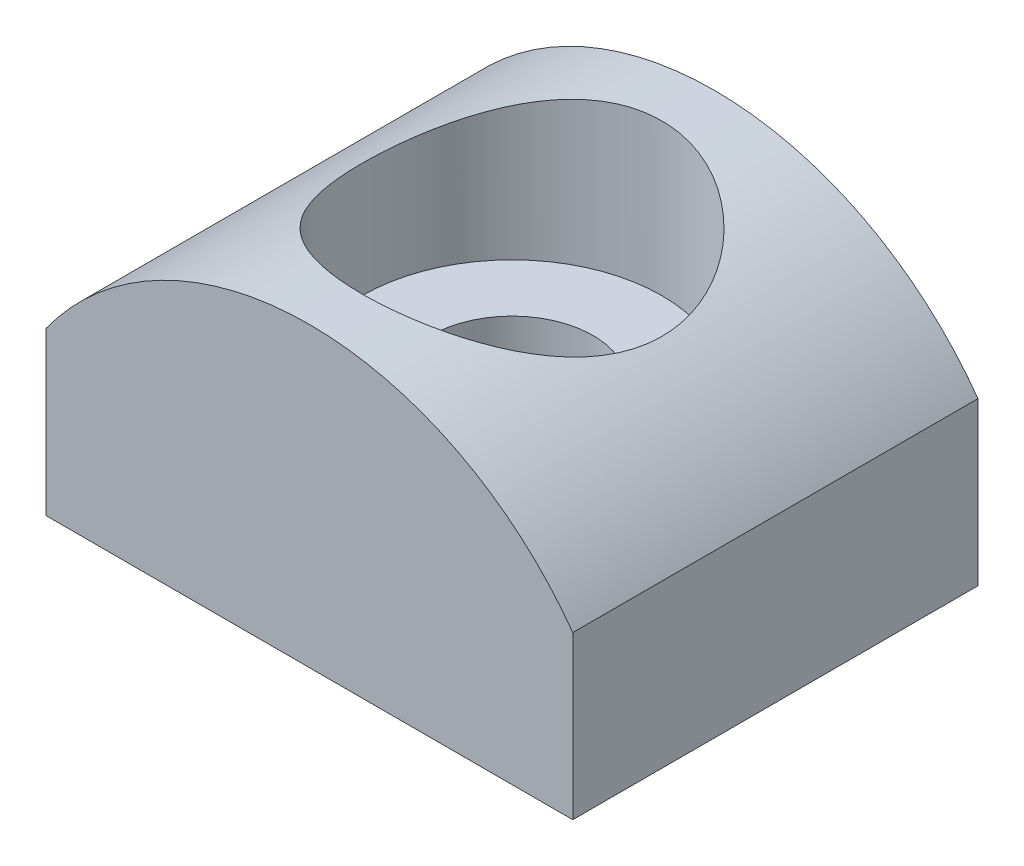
ISO-10303-21;
HEADER;
FILE_DESCRIPTION(('STEP AP214'),'2;1');
FILE_NAME('part.step','',(''),(''),'','','');
FILE_SCHEMA(('AUTOMOTIVE_DESIGN { 1 0 10303 214 1 1 1 1 }'));
ENDSEC;
DATA;
#1=APPLICATION_CONTEXT('core data for automotive mechanical design processes');
#2=APPLICATION_PROTOCOL_DEFINITION('international standard','automotive_design',2000,#1);
#3=PRODUCT_CONTEXT('',#1,'mechanical');
#4=PRODUCT('Part','Part','',(#3));
#5=PRODUCT_RELATED_PRODUCT_CATEGORY('part','',(#4));
#6=PRODUCT_DEFINITION_FORMATION('','',#4);
#7=PRODUCT_DEFINITION_CONTEXT('part definition',#1,'design');
#8=PRODUCT_DEFINITION('design','',#6,#7);
#9=PRODUCT_DEFINITION_SHAPE('','',#8);
#10=(LENGTH_UNIT() NAMED_UNIT(*) SI_UNIT(.MILLI.,.METRE.));
#11=(NAMED_UNIT(*) PLANE_ANGLE_UNIT() SI_UNIT($,.RADIAN.));
#12=(NAMED_UNIT(*) SI_UNIT($,.STERADIAN.) SOLID_ANGLE_UNIT());
#13=UNCERTAINTY_MEASURE_WITH_UNIT(LENGTH_MEASURE(1.E-05),#10,'distance_accuracy_value','');
#14=(GEOMETRIC_REPRESENTATION_CONTEXT(3) GLOBAL_UNCERTAINTY_ASSIGNED_CONTEXT((#13)) GLOBAL_UNIT_ASSIGNED_CONTEXT((#10,
#11,#12)) REPRESENTATION_CONTEXT('',''));
#15=CARTESIAN_POINT('',(0.,0.,0.));
#16=DIRECTION('',(0.,0.,1.));
#17=DIRECTION('',(1.,0.,0.));
#18=AXIS2_PLACEMENT_3D('',#15,#16,#17);
#19=CARTESIAN_POINT('',(6.5,0.,5.));
#20=DIRECTION('',(-1.,0.,0.));
#21=DIRECTION('',(0.,0.,1.));
#22=AXIS2_PLACEMENT_3D('',#19,#20,#21);
#23=PLANE('',#22);
#24=DIRECTION('',(0.,1.,0.));
#25=VECTOR('',#24,1.);
#26=CARTESIAN_POINT('',(6.5,0.,-5.));
#27=LINE('',#26,#25);
#28=CARTESIAN_POINT('',(6.5,0.,-5.));
#29=VERTEX_POINT('',#28);
#30=CARTESIAN_POINT('',(6.5,4.,-5.));
#31=VERTEX_POINT('',#30);
#32=EDGE_CURVE('E78',#29,#31,#27,.T.);
#33=ORIENTED_EDGE('',*,*,#32,.T.);
#34=DIRECTION('',(0.,0.,-1.));
#35=VECTOR('',#34,1.);
#36=CARTESIAN_POINT('',(6.5,4.,5.));
#37=LINE('',#36,#35);
#38=CARTESIAN_POINT('',(6.5,4.,5.));
#39=VERTEX_POINT('',#38);
#40=EDGE_CURVE('E11',#39,#31,#37,.T.);
#41=ORIENTED_EDGE('',*,*,#40,.F.);
#42=DIRECTION('',(0.,1.,0.));
#43=VECTOR('',#42,1.);
#44=CARTESIAN_POINT('',(6.5,0.,5.));
#45=LINE('',#44,#43);
#46=CARTESIAN_POINT('',(6.5,0.,5.));
#47=VERTEX_POINT('',#46);
#48=EDGE_CURVE('E100',#47,#39,#45,.T.);
#49=ORIENTED_EDGE('',*,*,#48,.F.);
#50=DIRECTION('',(0.,0.,-1.));
#51=VECTOR('',#50,1.);
#52=CARTESIAN_POINT('',(6.5,0.,5.));
#53=LINE('',#52,#51);
#54=EDGE_CURVE('E90',#47,#29,#53,.T.);
#55=ORIENTED_EDGE('',*,*,#54,.T.);
#56=EDGE_LOOP('',(#33,#41,#49,#55));
#57=FACE_BOUND('',#56,.T.);
#58=ADVANCED_FACE('F30',(#57),#23,.F.);
#59=CARTESIAN_POINT('',(0.,-0.66368952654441,5.));
#60=DIRECTION('',(0.,0.,-1.));
#61=DIRECTION('',(-1.,0.,0.));
#62=AXIS2_PLACEMENT_3D('',#59,#60,#61);
#63=CYLINDRICAL_SURFACE('',#62,8.);
#64=CARTESIAN_POINT('',(0.,7.33631047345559,3.7));
#65=CARTESIAN_POINT('',(-0.0981574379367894,7.33630985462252,3.69999926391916));
#66=CARTESIAN_POINT('',(-0.196334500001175,7.33449919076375,3.69608880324));
#67=CARTESIAN_POINT('',(-0.391975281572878,7.32730221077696,3.68048842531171));
#68=CARTESIAN_POINT('',(-0.489438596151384,7.32191400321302,3.66879439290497));
#69=CARTESIAN_POINT('',(-0.683059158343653,7.30768814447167,3.63772660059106));
#70=CARTESIAN_POINT('',(-0.77921383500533,7.2988445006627,3.61833949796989));
#71=CARTESIAN_POINT('',(-0.969367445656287,7.27794142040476,3.57210301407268));
#72=CARTESIAN_POINT('',(-1.06336548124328,7.26588066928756,3.54525058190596));
#73=CARTESIAN_POINT('',(-1.34039281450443,7.22541328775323,3.4541209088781));
#74=CARTESIAN_POINT('',(-1.51939060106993,7.19264847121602,3.3791184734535));
#75=CARTESIAN_POINT('',(-1.86195193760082,7.11859526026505,3.20317008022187));
#76=CARTESIAN_POINT('',(-2.0255182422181,7.07730839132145,3.10222876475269));
#77=CARTESIAN_POINT('',(-2.34264624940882,6.987492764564,2.87098157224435));
#78=CARTESIAN_POINT('',(-2.4951913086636,6.93869339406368,2.73938473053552));
#79=CARTESIAN_POINT('',(-2.77693928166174,6.84037118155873,2.45336397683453));
#80=CARTESIAN_POINT('',(-2.90612711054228,6.79084789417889,2.29892542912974));
#81=CARTESIAN_POINT('',(-3.14577253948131,6.69307204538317,1.95955571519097));
#82=CARTESIAN_POINT('',(-3.25451029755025,6.64510192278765,1.77330805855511));
#83=CARTESIAN_POINT('',(-3.39257590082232,6.58151548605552,1.48057985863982));
#84=CARTESIAN_POINT('',(-3.4344347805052,6.56170919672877,1.38073945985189));
#85=CARTESIAN_POINT('',(-3.50939605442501,6.52559916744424,1.17723109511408));
#86=CARTESIAN_POINT('',(-3.54250329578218,6.5092934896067,1.07356528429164));
#87=CARTESIAN_POINT('',(-3.59799080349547,6.48161460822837,0.868953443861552));
#88=CARTESIAN_POINT('',(-3.62085922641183,6.47002018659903,0.768169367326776));
#89=CARTESIAN_POINT('',(-3.65811429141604,6.45098819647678,0.564701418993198));
#90=CARTESIAN_POINT('',(-3.67250514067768,6.44354856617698,0.46201851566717));
#91=CARTESIAN_POINT('',(-3.69261462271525,6.43312148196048,0.255624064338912));
#92=CARTESIAN_POINT('',(-3.69833689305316,6.4301321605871,0.151912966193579));
#93=CARTESIAN_POINT('',(-3.70103694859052,6.42872390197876,-0.0556489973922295));
#94=CARTESIAN_POINT('',(-3.69801537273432,6.43030463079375,-0.1594998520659));
#95=CARTESIAN_POINT('',(-3.68400276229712,6.43759050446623,-0.356168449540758));
#96=CARTESIAN_POINT('',(-3.67382990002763,6.44287205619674,-0.44906109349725));
#97=CARTESIAN_POINT('',(-3.64654698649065,6.4569089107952,-0.633566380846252));
#98=CARTESIAN_POINT('',(-3.62943460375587,6.46566538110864,-0.725178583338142));
#99=CARTESIAN_POINT('',(-3.56794116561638,6.49675509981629,-0.997126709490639));
#100=CARTESIAN_POINT('',(-3.51339273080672,6.5239149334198,-1.17472516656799));
#101=CARTESIAN_POINT('',(-3.37770481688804,6.58867743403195,-1.52208701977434));
#102=CARTESIAN_POINT('',(-3.29598331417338,6.62650564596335,-1.69157673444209));
#103=CARTESIAN_POINT('',(-3.10867930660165,6.70832170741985,-2.01521388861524));
#104=CARTESIAN_POINT('',(-3.00308643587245,6.7523122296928,-2.1693546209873));
#105=CARTESIAN_POINT('',(-2.75789618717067,6.84717203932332,-2.47515513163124));
#106=CARTESIAN_POINT('',(-2.61587586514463,6.89827515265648,-2.62480506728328));
#107=CARTESIAN_POINT('',(-2.30838745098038,6.99773670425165,-2.89892834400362));
#108=CARTESIAN_POINT('',(-2.14291110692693,7.04609416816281,-3.0233927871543));
#109=CARTESIAN_POINT('',(-1.78588478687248,7.13667178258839,-3.24754105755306));
#110=CARTESIAN_POINT('',(-1.5936335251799,7.17862347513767,-3.34622475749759));
#111=CARTESIAN_POINT('',(-1.19281989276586,7.24949421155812,-3.5091145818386));
#112=CARTESIAN_POINT('',(-0.984268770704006,7.2784221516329,-3.57334424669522));
#113=CARTESIAN_POINT('',(-0.57339581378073,7.31820365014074,-3.6608759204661));
#114=CARTESIAN_POINT('',(-0.371760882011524,7.33023956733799,-3.68686228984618));
#115=CARTESIAN_POINT('',(0.0333379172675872,7.33880191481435,-3.70539514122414));
#116=CARTESIAN_POINT('',(0.236801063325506,7.33533421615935,-3.69795428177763));
#117=CARTESIAN_POINT('',(0.625985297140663,7.31401217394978,-3.65158733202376));
#118=CARTESIAN_POINT('',(0.812008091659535,7.29709349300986,-3.61470833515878));
#119=CARTESIAN_POINT('',(1.17493161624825,7.25167530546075,-3.51355026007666));
#120=CARTESIAN_POINT('',(1.35183126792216,7.2231744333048,-3.44926795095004));
#121=CARTESIAN_POINT('',(1.69770553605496,7.15614430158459,-3.2931618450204));
#122=CARTESIAN_POINT('',(1.86626831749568,7.11733323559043,-3.20055083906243));
#123=CARTESIAN_POINT('',(2.18606436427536,7.03361449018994,-2.99126633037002));
#124=CARTESIAN_POINT('',(2.3372899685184,6.98870413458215,-2.87458225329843));
#125=CARTESIAN_POINT('',(2.63191631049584,6.89270225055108,-2.60878013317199));
#126=CARTESIAN_POINT('',(2.77350962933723,6.84141203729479,-2.45772995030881));
#127=CARTESIAN_POINT('',(3.03006210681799,6.74155951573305,-2.13340880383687));
#128=CARTESIAN_POINT('',(3.1450091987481,6.69299845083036,-1.96012782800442));
#129=CARTESIAN_POINT('',(3.29646711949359,6.62578840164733,-1.68369781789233));
#130=CARTESIAN_POINT('',(3.34401288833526,6.60403829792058,-1.58720049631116));
#131=CARTESIAN_POINT('',(3.43070287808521,6.563520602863,-1.38991661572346));
#132=CARTESIAN_POINT('',(3.46985091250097,6.54475165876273,-1.28913202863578));
#133=CARTESIAN_POINT('',(3.5392933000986,6.51091129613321,-1.08402987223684));
#134=CARTESIAN_POINT('',(3.56959348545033,6.49583744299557,-0.97971468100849));
#135=CARTESIAN_POINT('',(3.62098233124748,6.46998536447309,-0.768318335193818));
#136=CARTESIAN_POINT('',(3.64207215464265,6.45920659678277,-0.661237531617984));
#137=CARTESIAN_POINT('',(3.67327266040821,6.44316252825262,-0.454927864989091));
#138=CARTESIAN_POINT('',(3.68419639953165,6.43749043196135,-0.355852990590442));
#139=CARTESIAN_POINT('',(3.69801363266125,6.43030487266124,-0.156957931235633));
#140=CARTESIAN_POINT('',(3.70090446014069,6.42879279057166,-0.0571375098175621));
#141=CARTESIAN_POINT('',(3.6986051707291,6.42999244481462,0.142326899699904));
#142=CARTESIAN_POINT('',(3.69342011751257,6.43270153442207,0.241970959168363));
#143=CARTESIAN_POINT('',(3.67505738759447,6.44222694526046,0.440333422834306));
#144=CARTESIAN_POINT('',(3.6618767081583,6.4490448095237,0.539051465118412));
#145=CARTESIAN_POINT('',(3.61298200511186,6.47407679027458,0.818746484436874));
#146=CARTESIAN_POINT('',(3.56763744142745,6.49705012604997,0.997717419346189));
#147=CARTESIAN_POINT('',(3.45163140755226,6.5536744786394,1.34532864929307));
#148=CARTESIAN_POINT('',(3.38096244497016,6.58732865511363,1.51396586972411));
#149=CARTESIAN_POINT('',(3.21101298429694,6.66424605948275,1.84847390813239));
#150=CARTESIAN_POINT('',(3.11015360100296,6.70799644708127,2.01342968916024));
#151=CARTESIAN_POINT('',(2.88462712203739,6.79913170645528,2.32507283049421));
#152=CARTESIAN_POINT('',(2.75994911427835,6.84651823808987,2.47175176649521));
#153=CARTESIAN_POINT('',(2.47597438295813,6.94514039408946,2.75753684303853));
#154=CARTESIAN_POINT('',(2.31448384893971,6.99629888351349,2.8944971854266));
#155=CARTESIAN_POINT('',(1.96899448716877,7.09228175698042,3.13972300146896));
#156=CARTESIAN_POINT('',(1.7849851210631,7.13710315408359,3.24797496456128));
#157=CARTESIAN_POINT('',(1.49640037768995,7.19572664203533,3.38557243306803));
#158=CARTESIAN_POINT('',(1.39839004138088,7.21379597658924,3.42722928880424));
#159=CARTESIAN_POINT('',(1.19867219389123,7.24664520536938,3.5020757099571));
#160=CARTESIAN_POINT('',(1.09696650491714,7.26142669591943,3.53526938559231));
#161=CARTESIAN_POINT('',(0.89086840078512,7.28723004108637,3.59273962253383));
#162=CARTESIAN_POINT('',(0.786482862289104,7.29826065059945,3.61703695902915));
#163=CARTESIAN_POINT('',(0.575706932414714,7.31626855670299,3.65650681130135));
#164=CARTESIAN_POINT('',(0.469317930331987,7.32324856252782,3.67168542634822));
#165=CARTESIAN_POINT('',(0.302231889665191,7.33082686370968,3.68813180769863));
#166=CARTESIAN_POINT('',(0.241894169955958,7.33288105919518,3.69258010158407));
#167=CARTESIAN_POINT('',(0.12104012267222,7.33562306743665,3.69851445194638));
#168=CARTESIAN_POINT('',(0.060523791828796,7.33631085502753,3.70000045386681));
#169=CARTESIAN_POINT('',(0.,7.33631047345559,3.7));
#170=B_SPLINE_CURVE_WITH_KNOTS('',3,(#64,#65,#66,#67,#68,#69,#70,#71,#72,#73,#74,#75,#76,#77,
#78,#79,#80,#81,#82,#83,#84,#85,#86,#87,#88,#89,#90,#91,#92,#93,#94,#95,#96,#97,#98,#99,#100,
#101,#102,#103,#104,#105,#106,#107,#108,#109,#110,#111,#112,#113,#114,#115,#116,#117,#118,#119,
#120,#121,#122,#123,#124,#125,#126,#127,#128,#129,#130,#131,#132,#133,#134,#135,#136,#137,#138,
#139,#140,#141,#142,#143,#144,#145,#146,#147,#148,#149,#150,#151,#152,#153,#154,#155,#156,#157,
#158,#159,#160,#161,#162,#163,#164,#165,#166,#167,#168,#169),.UNSPECIFIED.,.T.,.F.,(4,2,2,2,2,2,
2,2,2,2,2,2,2,2,2,2,2,2,2,2,2,2,2,2,2,2,2,2,2,2,2,2,2,2,2,2,2,2,2,2,2,2,2,2,2,2,2,2,2,2,2,2,4),
(0.,0.294411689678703,0.58897915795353,0.884059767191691,1.1792611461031,1.76684861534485,
2.35433099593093,2.97352543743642,3.59311835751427,4.25222374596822,4.58201312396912,
4.9116194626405,5.22317541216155,5.53457661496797,5.84584710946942,6.15709485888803,
6.43754428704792,6.71808801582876,7.27872645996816,7.85224296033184,8.42600898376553,
9.06083750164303,9.69588991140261,10.352795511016,11.0092517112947,11.6169747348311,
12.2244676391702,12.7930517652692,13.3617029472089,13.947866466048,14.5342880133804,
15.1714188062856,15.8088375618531,16.1377230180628,16.4664588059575,16.7949774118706,
17.1234545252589,17.422562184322,17.7217691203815,18.020788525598,18.3199202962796,
18.8754031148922,19.4310504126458,20.0233231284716,20.6158678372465,21.2663996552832,
21.9172370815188,22.2409232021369,22.5644518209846,22.8872200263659,23.2097720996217,
23.391302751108,23.5728367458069),.UNSPECIFIED.);
#171=CARTESIAN_POINT('',(0.,7.33631047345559,3.7));
#172=VERTEX_POINT('',#171);
#173=EDGE_CURVE('E33',#172,#172,#170,.T.);
#174=ORIENTED_EDGE('',*,*,#173,.T.);
#175=EDGE_LOOP('',(#174));
#176=FACE_BOUND('',#175,.T.);
#177=CARTESIAN_POINT('',(0.,-0.66368952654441,-5.));
#178=DIRECTION('',(0.,0.,1.));
#179=DIRECTION('',(1.,0.,0.));
#180=AXIS2_PLACEMENT_3D('',#177,#178,#179);
#181=CIRCLE('',#180,8.);
#182=CARTESIAN_POINT('',(-6.5,4.,-5.));
#183=VERTEX_POINT('',#182);
#184=EDGE_CURVE('E74',#31,#183,#181,.T.);
#185=ORIENTED_EDGE('',*,*,#184,.T.);
#186=DIRECTION('',(0.,0.,-1.));
#187=VECTOR('',#186,1.);
#188=CARTESIAN_POINT('',(-6.5,4.,5.));
#189=LINE('',#188,#187);
#190=CARTESIAN_POINT('',(-6.5,4.,5.));
#191=VERTEX_POINT('',#190);
#192=EDGE_CURVE('E41',#191,#183,#189,.T.);
#193=ORIENTED_EDGE('',*,*,#192,.F.);
#194=CARTESIAN_POINT('',(0.,-0.66368952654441,5.));
#195=DIRECTION('',(0.,0.,1.));
#196=DIRECTION('',(1.,0.,0.));
#197=AXIS2_PLACEMENT_3D('',#194,#195,#196);
#198=CIRCLE('',#197,8.);
#199=EDGE_CURVE('E86',#39,#191,#198,.T.);
#200=ORIENTED_EDGE('',*,*,#199,.F.);
#201=ORIENTED_EDGE('',*,*,#40,.T.);
#202=EDGE_LOOP('',(#185,#193,#200,#201));
#203=FACE_BOUND('',#202,.T.);
#204=ADVANCED_FACE('F85',(#176,#203),#63,.T.);
#205=CARTESIAN_POINT('',(-6.5,0.,5.));
#206=DIRECTION('',(1.,0.,0.));
#207=DIRECTION('',(0.,1.,0.));
#208=AXIS2_PLACEMENT_3D('',#205,#206,#207);
#209=PLANE('',#208);
#210=DIRECTION('',(0.,-1.,0.));
#211=VECTOR('',#210,1.);
#212=CARTESIAN_POINT('',(-6.5,0.,-5.));
#213=LINE('',#212,#211);
#214=CARTESIAN_POINT('',(-6.5,0.,-5.));
#215=VERTEX_POINT('',#214);
#216=EDGE_CURVE('E79',#183,#215,#213,.T.);
#217=ORIENTED_EDGE('',*,*,#216,.T.);
#218=DIRECTION('',(0.,0.,-1.));
#219=VECTOR('',#218,1.);
#220=CARTESIAN_POINT('',(-6.5,0.,5.));
#221=LINE('',#220,#219);
#222=CARTESIAN_POINT('',(-6.5,0.,5.));
#223=VERTEX_POINT('',#222);
#224=EDGE_CURVE('E106',#223,#215,#221,.T.);
#225=ORIENTED_EDGE('',*,*,#224,.F.);
#226=DIRECTION('',(0.,-1.,0.));
#227=VECTOR('',#226,1.);
#228=CARTESIAN_POINT('',(-6.5,0.,5.));
#229=LINE('',#228,#227);
#230=EDGE_CURVE('E53',#191,#223,#229,.T.);
#231=ORIENTED_EDGE('',*,*,#230,.F.);
#232=ORIENTED_EDGE('',*,*,#192,.T.);
#233=EDGE_LOOP('',(#217,#225,#231,#232));
#234=FACE_BOUND('',#233,.T.);
#235=ADVANCED_FACE('F110',(#234),#209,.F.);
#236=CARTESIAN_POINT('',(-6.5,0.,5.));
#237=DIRECTION('',(0.,1.,0.));
#238=DIRECTION('',(-1.,0.,0.));
#239=AXIS2_PLACEMENT_3D('',#236,#237,#238);
#240=PLANE('',#239);
#241=CARTESIAN_POINT('',(0.,0.,0.));
#242=DIRECTION('',(0.,1.,0.));
#243=DIRECTION('',(0.,0.,1.));
#244=AXIS2_PLACEMENT_3D('',#241,#242,#243);
#245=CIRCLE('',#244,2.);
#246=CARTESIAN_POINT('',(0.,0.,2.));
#247=VERTEX_POINT('',#246);
#248=EDGE_CURVE('E93',#247,#247,#245,.T.);
#249=ORIENTED_EDGE('',*,*,#248,.T.);
#250=EDGE_LOOP('',(#249));
#251=FACE_BOUND('',#250,.T.);
#252=DIRECTION('',(1.,0.,0.));
#253=VECTOR('',#252,1.);
#254=CARTESIAN_POINT('',(-6.5,0.,-5.));
#255=LINE('',#254,#253);
#256=EDGE_CURVE('E98',#215,#29,#255,.T.);
#257=ORIENTED_EDGE('',*,*,#256,.T.);
#258=ORIENTED_EDGE('',*,*,#54,.F.);
#259=DIRECTION('',(1.,0.,0.));
#260=VECTOR('',#259,1.);
#261=CARTESIAN_POINT('',(-6.5,0.,5.));
#262=LINE('',#261,#260);
#263=EDGE_CURVE('E48',#223,#47,#262,.T.);
#264=ORIENTED_EDGE('',*,*,#263,.F.);
#265=ORIENTED_EDGE('',*,*,#224,.T.);
#266=EDGE_LOOP('',(#257,#258,#264,#265));
#267=FACE_BOUND('',#266,.T.);
#268=ADVANCED_FACE('F112',(#251,#267),#240,.F.);
#269=CARTESIAN_POINT('',(0.,-0.66368952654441,5.));
#270=DIRECTION('',(0.,0.,1.));
#271=DIRECTION('',(1.,0.,0.));
#272=AXIS2_PLACEMENT_3D('',#269,#270,#271);
#273=PLANE('',#272);
#274=ORIENTED_EDGE('',*,*,#48,.T.);
#275=ORIENTED_EDGE('',*,*,#199,.T.);
#276=ORIENTED_EDGE('',*,*,#230,.T.);
#277=ORIENTED_EDGE('',*,*,#263,.T.);
#278=EDGE_LOOP('',(#274,#275,#276,#277));
#279=FACE_BOUND('',#278,.T.);
#280=ADVANCED_FACE('F113',(#279),#273,.T.);
#281=CARTESIAN_POINT('',(0.,-0.66368952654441,-5.));
#282=DIRECTION('',(0.,0.,1.));
#283=DIRECTION('',(1.,0.,0.));
#284=AXIS2_PLACEMENT_3D('',#281,#282,#283);
#285=PLANE('',#284);
#286=ORIENTED_EDGE('',*,*,#32,.F.);
#287=ORIENTED_EDGE('',*,*,#256,.F.);
#288=ORIENTED_EDGE('',*,*,#216,.F.);
#289=ORIENTED_EDGE('',*,*,#184,.F.);
#290=EDGE_LOOP('',(#286,#287,#288,#289));
#291=FACE_BOUND('',#290,.T.);
#292=ADVANCED_FACE('F75',(#291),#285,.F.);
#293=CARTESIAN_POINT('',(0.,5.,0.));
#294=DIRECTION('',(0.,1.,0.));
#295=DIRECTION('',(0.,0.,1.));
#296=AXIS2_PLACEMENT_3D('',#293,#294,#295);
#297=CYLINDRICAL_SURFACE('',#296,3.7);
#298=CARTESIAN_POINT('',(0.,3.6,0.));
#299=DIRECTION('',(0.,1.,0.));
#300=DIRECTION('',(0.,0.,1.));
#301=AXIS2_PLACEMENT_3D('',#298,#299,#300);
#302=CIRCLE('',#301,3.7);
#303=CARTESIAN_POINT('',(0.,3.6,3.7));
#304=VERTEX_POINT('',#303);
#305=EDGE_CURVE('E157',#304,#304,#302,.T.);
#306=ORIENTED_EDGE('',*,*,#305,.F.);
#307=EDGE_LOOP('',(#306));
#308=FACE_BOUND('',#307,.T.);
#309=ORIENTED_EDGE('',*,*,#173,.F.);
#310=EDGE_LOOP('',(#309));
#311=FACE_BOUND('',#310,.T.);
#312=ADVANCED_FACE('F120',(#308,#311),#297,.F.);
#313=CARTESIAN_POINT('',(0.,5.,0.));
#314=DIRECTION('',(0.,1.,0.));
#315=DIRECTION('',(0.,0.,1.));
#316=AXIS2_PLACEMENT_3D('',#313,#314,#315);
#317=CYLINDRICAL_SURFACE('',#316,2.);
#318=ORIENTED_EDGE('',*,*,#248,.F.);
#319=EDGE_LOOP('',(#318));
#320=FACE_BOUND('',#319,.T.);
#321=CARTESIAN_POINT('',(0.,3.6,0.));
#322=DIRECTION('',(0.,1.,0.));
#323=DIRECTION('',(0.,0.,1.));
#324=AXIS2_PLACEMENT_3D('',#321,#322,#323);
#325=CIRCLE('',#324,2.);
#326=CARTESIAN_POINT('',(0.,3.6,2.));
#327=VERTEX_POINT('',#326);
#328=EDGE_CURVE('E155',#327,#327,#325,.T.);
#329=ORIENTED_EDGE('',*,*,#328,.T.);
#330=EDGE_LOOP('',(#329));
#331=FACE_BOUND('',#330,.T.);
#332=ADVANCED_FACE('F137',(#320,#331),#317,.F.);
#333=CARTESIAN_POINT('',(0.,3.6,2.));
#334=DIRECTION('',(0.,-1.,0.));
#335=DIRECTION('',(0.,0.,-1.));
#336=AXIS2_PLACEMENT_3D('',#333,#334,#335);
#337=PLANE('',#336);
#338=ORIENTED_EDGE('',*,*,#328,.F.);
#339=EDGE_LOOP('',(#338));
#340=FACE_BOUND('',#339,.T.);
#341=ORIENTED_EDGE('',*,*,#305,.T.);
#342=EDGE_LOOP('',(#341));
#343=FACE_BOUND('',#342,.T.);
#344=ADVANCED_FACE('F142',(#340,#343),#337,.F.);
#345=CLOSED_SHELL('',(#58,#204,#235,#268,#280,#292,#312,#332,#344));
#346=MANIFOLD_SOLID_BREP('B2',#345);
#347=ADVANCED_BREP_SHAPE_REPRESENTATION('',(#18,#346),#14);
#348=SHAPE_DEFINITION_REPRESENTATION(#9,#347);
ENDSEC;
END-ISO-10303-21;
